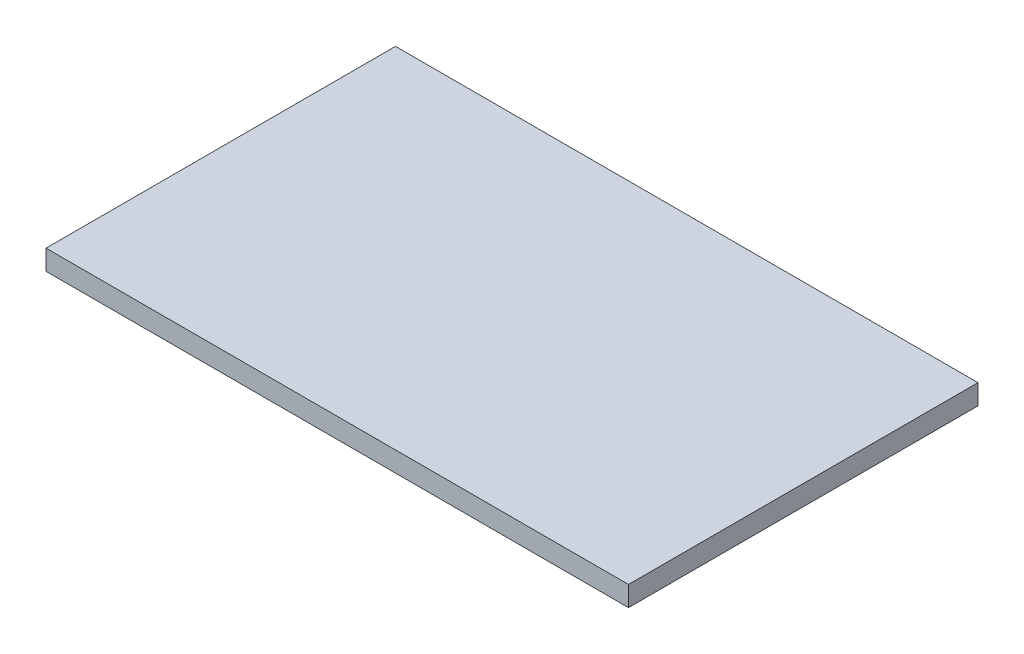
ISO-10303-21;
HEADER;
FILE_DESCRIPTION(('STEP AP214'),'2;1');
FILE_NAME('part.step','',(''),(''),'','','');
FILE_SCHEMA(('AUTOMOTIVE_DESIGN { 1 0 10303 214 1 1 1 1 }'));
ENDSEC;
DATA;
#1=APPLICATION_CONTEXT('core data for automotive mechanical design processes');
#2=APPLICATION_PROTOCOL_DEFINITION('international standard','automotive_design',2000,#1);
#3=PRODUCT_CONTEXT('',#1,'mechanical');
#4=PRODUCT('Part','Part','',(#3));
#5=PRODUCT_RELATED_PRODUCT_CATEGORY('part','',(#4));
#6=PRODUCT_DEFINITION_FORMATION('','',#4);
#7=PRODUCT_DEFINITION_CONTEXT('part definition',#1,'design');
#8=PRODUCT_DEFINITION('design','',#6,#7);
#9=PRODUCT_DEFINITION_SHAPE('','',#8);
#10=(LENGTH_UNIT() NAMED_UNIT(*) SI_UNIT(.MILLI.,.METRE.));
#11=(NAMED_UNIT(*) PLANE_ANGLE_UNIT() SI_UNIT($,.RADIAN.));
#12=(NAMED_UNIT(*) SI_UNIT($,.STERADIAN.) SOLID_ANGLE_UNIT());
#13=UNCERTAINTY_MEASURE_WITH_UNIT(LENGTH_MEASURE(1.E-05),#10,'distance_accuracy_value','');
#14=(GEOMETRIC_REPRESENTATION_CONTEXT(3) GLOBAL_UNCERTAINTY_ASSIGNED_CONTEXT((#13)) GLOBAL_UNIT_ASSIGNED_CONTEXT((#10,
#11,#12)) REPRESENTATION_CONTEXT('',''));
#15=CARTESIAN_POINT('',(0.,0.,0.));
#16=DIRECTION('',(0.,0.,1.));
#17=DIRECTION('',(1.,0.,0.));
#18=AXIS2_PLACEMENT_3D('',#15,#16,#17);
#19=CARTESIAN_POINT('',(0.,8.763,0.));
#20=DIRECTION('',(1.,0.,0.));
#21=DIRECTION('',(0.,0.,-1.));
#22=AXIS2_PLACEMENT_3D('',#19,#20,#21);
#23=PLANE('',#22);
#24=DIRECTION('',(0.,0.,1.));
#25=VECTOR('',#24,1.);
#26=CARTESIAN_POINT('',(0.,0.,0.));
#27=LINE('',#26,#25);
#28=CARTESIAN_POINT('',(0.,0.,-152.4));
#29=VERTEX_POINT('',#28);
#30=CARTESIAN_POINT('',(0.,0.,0.));
#31=VERTEX_POINT('',#30);
#32=EDGE_CURVE('E95',#29,#31,#27,.T.);
#33=ORIENTED_EDGE('',*,*,#32,.T.);
#34=DIRECTION('',(0.,-1.,0.));
#35=VECTOR('',#34,1.);
#36=CARTESIAN_POINT('',(0.,8.763,0.));
#37=LINE('',#36,#35);
#38=CARTESIAN_POINT('',(0.,8.763,0.));
#39=VERTEX_POINT('',#38);
#40=EDGE_CURVE('E11',#39,#31,#37,.T.);
#41=ORIENTED_EDGE('',*,*,#40,.F.);
#42=DIRECTION('',(0.,0.,1.));
#43=VECTOR('',#42,1.);
#44=CARTESIAN_POINT('',(0.,8.763,0.));
#45=LINE('',#44,#43);
#46=CARTESIAN_POINT('',(0.,8.763,-152.4));
#47=VERTEX_POINT('',#46);
#48=EDGE_CURVE('E83',#47,#39,#45,.T.);
#49=ORIENTED_EDGE('',*,*,#48,.F.);
#50=DIRECTION('',(0.,-1.,0.));
#51=VECTOR('',#50,1.);
#52=CARTESIAN_POINT('',(0.,8.763,-152.4));
#53=LINE('',#52,#51);
#54=EDGE_CURVE('E91',#47,#29,#53,.T.);
#55=ORIENTED_EDGE('',*,*,#54,.T.);
#56=EDGE_LOOP('',(#33,#41,#49,#55));
#57=FACE_BOUND('',#56,.T.);
#58=ADVANCED_FACE('F32',(#57),#23,.F.);
#59=CARTESIAN_POINT('',(0.,8.763,0.));
#60=DIRECTION('',(0.,0.,-1.));
#61=DIRECTION('',(-1.,0.,0.));
#62=AXIS2_PLACEMENT_3D('',#59,#60,#61);
#63=PLANE('',#62);
#64=DIRECTION('',(1.,0.,0.));
#65=VECTOR('',#64,1.);
#66=CARTESIAN_POINT('',(0.,0.,0.));
#67=LINE('',#66,#65);
#68=CARTESIAN_POINT('',(254.,0.,0.));
#69=VERTEX_POINT('',#68);
#70=EDGE_CURVE('E87',#31,#69,#67,.T.);
#71=ORIENTED_EDGE('',*,*,#70,.T.);
#72=DIRECTION('',(0.,-1.,0.));
#73=VECTOR('',#72,1.);
#74=CARTESIAN_POINT('',(254.,8.763,0.));
#75=LINE('',#74,#73);
#76=CARTESIAN_POINT('',(254.,8.763,0.));
#77=VERTEX_POINT('',#76);
#78=EDGE_CURVE('E40',#77,#69,#75,.T.);
#79=ORIENTED_EDGE('',*,*,#78,.F.);
#80=DIRECTION('',(1.,0.,0.));
#81=VECTOR('',#80,1.);
#82=CARTESIAN_POINT('',(0.,8.763,0.));
#83=LINE('',#82,#81);
#84=EDGE_CURVE('E78',#39,#77,#83,.T.);
#85=ORIENTED_EDGE('',*,*,#84,.F.);
#86=ORIENTED_EDGE('',*,*,#40,.T.);
#87=EDGE_LOOP('',(#71,#79,#85,#86));
#88=FACE_BOUND('',#87,.T.);
#89=ADVANCED_FACE('F86',(#88),#63,.F.);
#90=CARTESIAN_POINT('',(254.,8.763,0.));
#91=DIRECTION('',(-1.,0.,0.));
#92=DIRECTION('',(0.,0.,1.));
#93=AXIS2_PLACEMENT_3D('',#90,#91,#92);
#94=PLANE('',#93);
#95=DIRECTION('',(0.,0.,-1.));
#96=VECTOR('',#95,1.);
#97=CARTESIAN_POINT('',(254.,0.,0.));
#98=LINE('',#97,#96);
#99=CARTESIAN_POINT('',(254.,0.,-152.4));
#100=VERTEX_POINT('',#99);
#101=EDGE_CURVE('E65',#69,#100,#98,.T.);
#102=ORIENTED_EDGE('',*,*,#101,.T.);
#103=DIRECTION('',(0.,-1.,0.));
#104=VECTOR('',#103,1.);
#105=CARTESIAN_POINT('',(254.,8.763,-152.4));
#106=LINE('',#105,#104);
#107=CARTESIAN_POINT('',(254.,8.763,-152.4));
#108=VERTEX_POINT('',#107);
#109=EDGE_CURVE('E88',#108,#100,#106,.T.);
#110=ORIENTED_EDGE('',*,*,#109,.F.);
#111=DIRECTION('',(0.,0.,-1.));
#112=VECTOR('',#111,1.);
#113=CARTESIAN_POINT('',(254.,8.763,0.));
#114=LINE('',#113,#112);
#115=EDGE_CURVE('E81',#77,#108,#114,.T.);
#116=ORIENTED_EDGE('',*,*,#115,.F.);
#117=ORIENTED_EDGE('',*,*,#78,.T.);
#118=EDGE_LOOP('',(#102,#110,#116,#117));
#119=FACE_BOUND('',#118,.T.);
#120=ADVANCED_FACE('F89',(#119),#94,.F.);
#121=CARTESIAN_POINT('',(0.,8.763,-152.4));
#122=DIRECTION('',(0.,0.,1.));
#123=DIRECTION('',(1.,0.,0.));
#124=AXIS2_PLACEMENT_3D('',#121,#122,#123);
#125=PLANE('',#124);
#126=DIRECTION('',(-1.,0.,0.));
#127=VECTOR('',#126,1.);
#128=CARTESIAN_POINT('',(0.,0.,-152.4));
#129=LINE('',#128,#127);
#130=EDGE_CURVE('E71',#100,#29,#129,.T.);
#131=ORIENTED_EDGE('',*,*,#130,.T.);
#132=ORIENTED_EDGE('',*,*,#54,.F.);
#133=DIRECTION('',(-1.,0.,0.));
#134=VECTOR('',#133,1.);
#135=CARTESIAN_POINT('',(0.,8.763,-152.4));
#136=LINE('',#135,#134);
#137=EDGE_CURVE('E48',#108,#47,#136,.T.);
#138=ORIENTED_EDGE('',*,*,#137,.F.);
#139=ORIENTED_EDGE('',*,*,#109,.T.);
#140=EDGE_LOOP('',(#131,#132,#138,#139));
#141=FACE_BOUND('',#140,.T.);
#142=ADVANCED_FACE('F102',(#141),#125,.F.);
#143=CARTESIAN_POINT('',(0.,8.763,-152.4));
#144=DIRECTION('',(0.,-1.,0.));
#145=DIRECTION('',(0.,0.,-1.));
#146=AXIS2_PLACEMENT_3D('',#143,#144,#145);
#147=PLANE('',#146);
#148=ORIENTED_EDGE('',*,*,#48,.T.);
#149=ORIENTED_EDGE('',*,*,#84,.T.);
#150=ORIENTED_EDGE('',*,*,#115,.T.);
#151=ORIENTED_EDGE('',*,*,#137,.T.);
#152=EDGE_LOOP('',(#148,#149,#150,#151));
#153=FACE_BOUND('',#152,.T.);
#154=ADVANCED_FACE('F79',(#153),#147,.F.);
#155=CARTESIAN_POINT('',(0.,0.,-152.4));
#156=DIRECTION('',(0.,-1.,0.));
#157=DIRECTION('',(0.,0.,-1.));
#158=AXIS2_PLACEMENT_3D('',#155,#156,#157);
#159=PLANE('',#158);
#160=ORIENTED_EDGE('',*,*,#32,.F.);
#161=ORIENTED_EDGE('',*,*,#130,.F.);
#162=ORIENTED_EDGE('',*,*,#101,.F.);
#163=ORIENTED_EDGE('',*,*,#70,.F.);
#164=EDGE_LOOP('',(#160,#161,#162,#163));
#165=FACE_BOUND('',#164,.T.);
#166=ADVANCED_FACE('F105',(#165),#159,.T.);
#167=CLOSED_SHELL('',(#58,#89,#120,#142,#154,#166));
#168=MANIFOLD_SOLID_BREP('B2',#167);
#169=ADVANCED_BREP_SHAPE_REPRESENTATION('',(#18,#168),#14);
#170=SHAPE_DEFINITION_REPRESENTATION(#9,#169);
ENDSEC;
END-ISO-10303-21;
